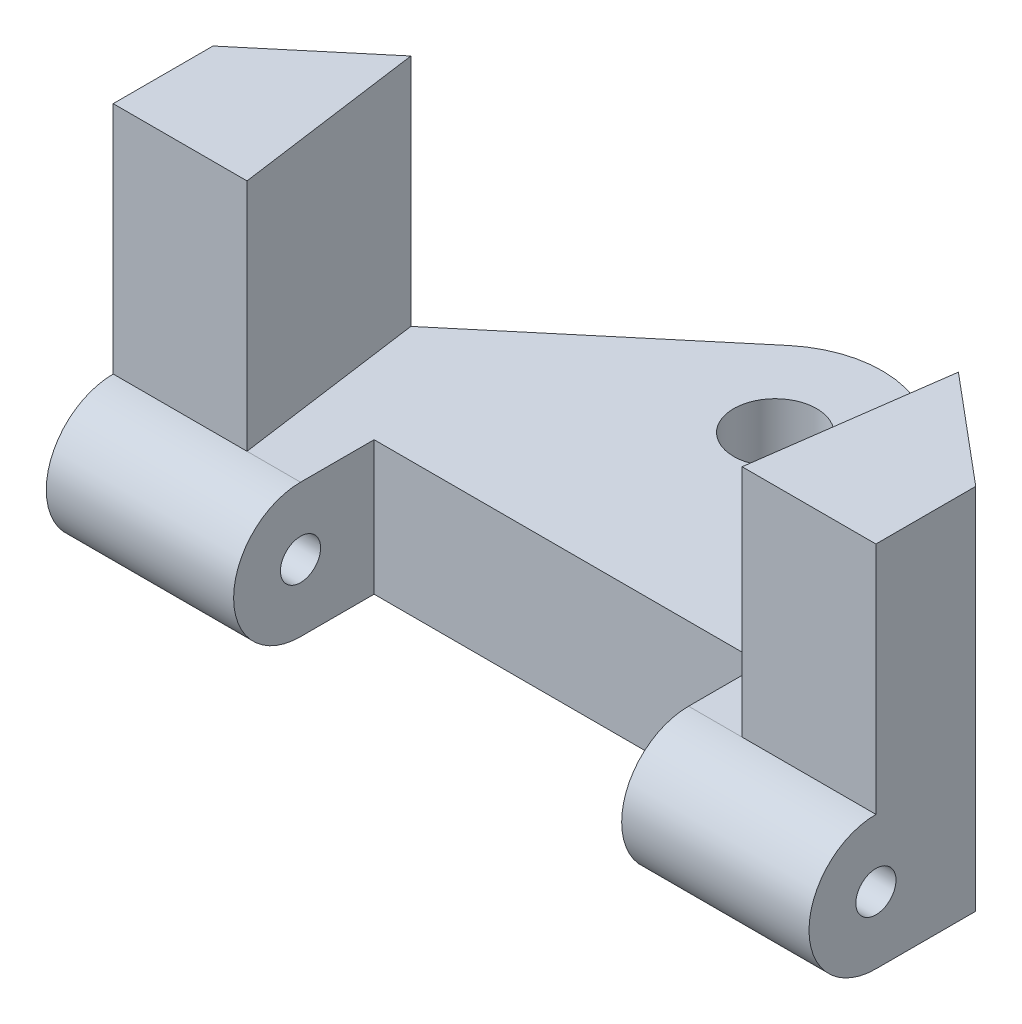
ISO-10303-21;
HEADER;
FILE_DESCRIPTION(('STEP AP214'),'2;1');
FILE_NAME('part.step','',(''),(''),'','','');
FILE_SCHEMA(('AUTOMOTIVE_DESIGN { 1 0 10303 214 1 1 1 1 }'));
ENDSEC;
DATA;
#1=APPLICATION_CONTEXT('core data for automotive mechanical design processes');
#2=APPLICATION_PROTOCOL_DEFINITION('international standard','automotive_design',2000,#1);
#3=PRODUCT_CONTEXT('',#1,'mechanical');
#4=PRODUCT('Part','Part','',(#3));
#5=PRODUCT_RELATED_PRODUCT_CATEGORY('part','',(#4));
#6=PRODUCT_DEFINITION_FORMATION('','',#4);
#7=PRODUCT_DEFINITION_CONTEXT('part definition',#1,'design');
#8=PRODUCT_DEFINITION('design','',#6,#7);
#9=PRODUCT_DEFINITION_SHAPE('','',#8);
#10=(LENGTH_UNIT() NAMED_UNIT(*) SI_UNIT(.MILLI.,.METRE.));
#11=(NAMED_UNIT(*) PLANE_ANGLE_UNIT() SI_UNIT($,.RADIAN.));
#12=(NAMED_UNIT(*) SI_UNIT($,.STERADIAN.) SOLID_ANGLE_UNIT());
#13=UNCERTAINTY_MEASURE_WITH_UNIT(LENGTH_MEASURE(1.E-05),#10,'distance_accuracy_value','');
#14=(GEOMETRIC_REPRESENTATION_CONTEXT(3) GLOBAL_UNCERTAINTY_ASSIGNED_CONTEXT((#13)) GLOBAL_UNIT_ASSIGNED_CONTEXT((#10,
#11,#12)) REPRESENTATION_CONTEXT('',''));
#15=CARTESIAN_POINT('',(0.,0.,0.));
#16=DIRECTION('',(0.,0.,1.));
#17=DIRECTION('',(1.,0.,0.));
#18=AXIS2_PLACEMENT_3D('',#15,#16,#17);
#19=CARTESIAN_POINT('',(0.,-11.9595744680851,0.));
#20=DIRECTION('',(0.,-1.,0.));
#21=DIRECTION('',(0.,0.,-1.));
#22=AXIS2_PLACEMENT_3D('',#19,#20,#21);
#23=PLANE('',#22);
#24=DIRECTION('',(-0.13663739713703,0.,0.990621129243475));
#25=VECTOR('',#24,1.);
#26=CARTESIAN_POINT('',(22.1540517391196,-11.9595744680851,3.05573127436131));
#27=LINE('',#26,#25);
#28=CARTESIAN_POINT('',(22.5349844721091,-11.9595744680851,0.293968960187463));
#29=VERTEX_POINT('',#28);
#30=CARTESIAN_POINT('',(20.5755319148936,-11.9595744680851,14.5));
#31=VERTEX_POINT('',#30);
#32=EDGE_CURVE('E313',#29,#31,#27,.T.);
#33=ORIENTED_EDGE('',*,*,#32,.T.);
#34=DIRECTION('',(-1.,0.,0.));
#35=VECTOR('',#34,1.);
#36=CARTESIAN_POINT('',(30.5755319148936,-11.9595744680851,14.5));
#37=LINE('',#36,#35);
#38=CARTESIAN_POINT('',(30.5755319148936,-11.9595744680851,14.5));
#39=VERTEX_POINT('',#38);
#40=EDGE_CURVE('E46',#39,#31,#37,.T.);
#41=ORIENTED_EDGE('',*,*,#40,.F.);
#42=DIRECTION('',(0.,0.,1.));
#43=VECTOR('',#42,1.);
#44=CARTESIAN_POINT('',(30.5755319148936,-11.9595744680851,0.));
#45=LINE('',#44,#43);
#46=CARTESIAN_POINT('',(30.5755319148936,-11.9595744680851,7.04078935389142));
#47=VERTEX_POINT('',#46);
#48=EDGE_CURVE('E115',#47,#39,#45,.T.);
#49=ORIENTED_EDGE('',*,*,#48,.F.);
#50=DIRECTION('',(0.766044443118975,0.,0.642787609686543));
#51=VECTOR('',#50,1.);
#52=CARTESIAN_POINT('',(9.16616128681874,-11.9595744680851,-10.9238056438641));
#53=LINE('',#52,#51);
#54=EDGE_CURVE('E234',#29,#47,#53,.T.);
#55=ORIENTED_EDGE('',*,*,#54,.F.);
#56=EDGE_LOOP('',(#33,#41,#49,#55));
#57=FACE_BOUND('',#56,.T.);
#58=ADVANCED_FACE('F37',(#57),#23,.F.);
#59=CARTESIAN_POINT('',(9.16616128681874,-39.4595744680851,-10.9238056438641));
#60=DIRECTION('',(-0.642787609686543,0.,0.766044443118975));
#61=DIRECTION('',(0.766044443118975,0.,0.642787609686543));
#62=AXIS2_PLACEMENT_3D('',#59,#60,#61);
#63=PLANE('',#62);
#64=DIRECTION('',(0.,1.,0.));
#65=VECTOR('',#64,1.);
#66=CARTESIAN_POINT('',(22.5349844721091,-44.0913704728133,0.293968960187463));
#67=LINE('',#66,#65);
#68=CARTESIAN_POINT('',(22.5349844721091,-29.4595744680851,0.293968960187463));
#69=VERTEX_POINT('',#68);
#70=EDGE_CURVE('E310',#69,#29,#67,.T.);
#71=ORIENTED_EDGE('',*,*,#70,.T.);
#72=ORIENTED_EDGE('',*,*,#54,.T.);
#73=DIRECTION('',(0.,1.,0.));
#74=VECTOR('',#73,1.);
#75=CARTESIAN_POINT('',(30.5755319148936,-39.4595744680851,7.04078935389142));
#76=LINE('',#75,#74);
#77=CARTESIAN_POINT('',(30.5755319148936,-39.4595744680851,7.04078935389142));
#78=VERTEX_POINT('',#77);
#79=EDGE_CURVE('E264',#78,#47,#76,.T.);
#80=ORIENTED_EDGE('',*,*,#79,.F.);
#81=DIRECTION('',(0.766044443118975,0.,0.642787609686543));
#82=VECTOR('',#81,1.);
#83=CARTESIAN_POINT('',(9.16616128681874,-39.4595744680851,-10.9238056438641));
#84=LINE('',#83,#82);
#85=CARTESIAN_POINT('',(6.68996351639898,-39.4595744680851,-13.0015822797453));
#86=VERTEX_POINT('',#85);
#87=EDGE_CURVE('E261',#86,#78,#84,.T.);
#88=ORIENTED_EDGE('',*,*,#87,.F.);
#89=DIRECTION('',(0.,1.,0.));
#90=VECTOR('',#89,1.);
#91=CARTESIAN_POINT('',(6.68996351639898,-39.4595744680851,-13.0015822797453));
#92=LINE('',#91,#90);
#93=CARTESIAN_POINT('',(6.68996351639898,-29.4595744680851,-13.0015822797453));
#94=VERTEX_POINT('',#93);
#95=EDGE_CURVE('E160',#86,#94,#92,.T.);
#96=ORIENTED_EDGE('',*,*,#95,.T.);
#97=DIRECTION('',(0.766044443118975,0.,0.642787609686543));
#98=VECTOR('',#97,1.);
#99=CARTESIAN_POINT('',(9.16616128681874,-29.4595744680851,-10.9238056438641));
#100=LINE('',#99,#98);
#101=EDGE_CURVE('E54',#94,#69,#100,.T.);
#102=ORIENTED_EDGE('',*,*,#101,.T.);
#103=EDGE_LOOP('',(#71,#72,#80,#88,#96,#102));
#104=FACE_BOUND('',#103,.T.);
#105=ADVANCED_FACE('F342',(#104),#63,.F.);
#106=CARTESIAN_POINT('',(-16.4244680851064,-29.4595744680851,9.));
#107=DIRECTION('',(0.,1.,0.));
#108=DIRECTION('',(0.,0.,1.));
#109=AXIS2_PLACEMENT_3D('',#106,#107,#108);
#110=PLANE('',#109);
#111=DIRECTION('',(-0.766044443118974,0.,0.642787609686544));
#112=VECTOR('',#111,1.);
#113=CARTESIAN_POINT('',(-7.45104170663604,-29.4595744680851,-8.87980572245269));
#114=LINE('',#113,#112);
#115=CARTESIAN_POINT('',(-3.04328166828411,-29.4595744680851,-12.5783555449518));
#116=VERTEX_POINT('',#115);
#117=CARTESIAN_POINT('',(-18.3839206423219,-29.4595744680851,0.29396896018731));
#118=VERTEX_POINT('',#117);
#119=EDGE_CURVE('E233',#116,#118,#114,.T.);
#120=ORIENTED_EDGE('',*,*,#119,.T.);
#121=DIRECTION('',(-0.136637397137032,0.,-0.990621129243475));
#122=VECTOR('',#121,1.);
#123=CARTESIAN_POINT('',(-18.0804873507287,-29.4595744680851,2.49386032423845));
#124=LINE('',#123,#122);
#125=CARTESIAN_POINT('',(-16.4244680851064,-29.4595744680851,14.5));
#126=VERTEX_POINT('',#125);
#127=EDGE_CURVE('E217',#126,#118,#124,.T.);
#128=ORIENTED_EDGE('',*,*,#127,.F.);
#129=DIRECTION('',(-1.,0.,0.));
#130=VECTOR('',#129,1.);
#131=CARTESIAN_POINT('',(-12.4244680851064,-29.4595744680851,14.5));
#132=LINE('',#131,#130);
#133=CARTESIAN_POINT('',(-12.4244680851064,-29.4595744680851,14.5));
#134=VERTEX_POINT('',#133);
#135=EDGE_CURVE('E173',#134,#126,#132,.T.);
#136=ORIENTED_EDGE('',*,*,#135,.F.);
#137=DIRECTION('',(0.,0.,1.));
#138=VECTOR('',#137,1.);
#139=CARTESIAN_POINT('',(-12.4244680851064,-29.4595744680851,0.));
#140=LINE('',#139,#138);
#141=CARTESIAN_POINT('',(-12.4244680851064,-29.4595744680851,9.));
#142=VERTEX_POINT('',#141);
#143=EDGE_CURVE('E133',#142,#134,#140,.T.);
#144=ORIENTED_EDGE('',*,*,#143,.F.);
#145=DIRECTION('',(1.,0.,0.));
#146=VECTOR('',#145,1.);
#147=CARTESIAN_POINT('',(-16.4244680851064,-29.4595744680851,9.));
#148=LINE('',#147,#146);
#149=CARTESIAN_POINT('',(16.5755319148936,-29.4595744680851,9.));
#150=VERTEX_POINT('',#149);
#151=EDGE_CURVE('E169',#142,#150,#148,.T.);
#152=ORIENTED_EDGE('',*,*,#151,.T.);
#153=DIRECTION('',(0.,0.,1.));
#154=VECTOR('',#153,1.);
#155=CARTESIAN_POINT('',(16.5755319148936,-29.4595744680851,0.));
#156=LINE('',#155,#154);
#157=CARTESIAN_POINT('',(16.5755319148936,-29.4595744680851,14.5));
#158=VERTEX_POINT('',#157);
#159=EDGE_CURVE('E168',#150,#158,#156,.T.);
#160=ORIENTED_EDGE('',*,*,#159,.T.);
#161=DIRECTION('',(1.,0.,0.));
#162=VECTOR('',#161,1.);
#163=CARTESIAN_POINT('',(16.5755319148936,-29.4595744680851,14.5));
#164=LINE('',#163,#162);
#165=CARTESIAN_POINT('',(20.5755319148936,-29.4595744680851,14.5));
#166=VERTEX_POINT('',#165);
#167=EDGE_CURVE('E172',#158,#166,#164,.T.);
#168=ORIENTED_EDGE('',*,*,#167,.T.);
#169=DIRECTION('',(0.13663739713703,0.,-0.990621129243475));
#170=VECTOR('',#169,1.);
#171=CARTESIAN_POINT('',(22.1540517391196,-29.4595744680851,3.05573127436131));
#172=LINE('',#171,#170);
#173=EDGE_CURVE('E312',#166,#69,#172,.T.);
#174=ORIENTED_EDGE('',*,*,#173,.T.);
#175=ORIENTED_EDGE('',*,*,#101,.F.);
#176=CARTESIAN_POINT('',(2.09901920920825,-29.4595744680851,-6.45));
#177=DIRECTION('',(0.,1.,0.));
#178=DIRECTION('',(0.,0.,1.));
#179=AXIS2_PLACEMENT_3D('',#176,#177,#178);
#180=CIRCLE('',#179,8.);
#181=EDGE_CURVE('E284',#94,#116,#180,.T.);
#182=ORIENTED_EDGE('',*,*,#181,.T.);
#183=EDGE_LOOP('',(#120,#128,#136,#144,#152,#160,#168,#174,#175,#182));
#184=FACE_BOUND('',#183,.T.);
#185=CARTESIAN_POINT('',(2.09901920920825,-29.4595744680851,-6.45));
#186=DIRECTION('',(0.,1.,0.));
#187=DIRECTION('',(0.,0.,1.));
#188=AXIS2_PLACEMENT_3D('',#185,#186,#187);
#189=CIRCLE('',#188,3.1);
#190=CARTESIAN_POINT('',(2.09901920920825,-29.4595744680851,-3.35));
#191=VERTEX_POINT('',#190);
#192=EDGE_CURVE('E290',#191,#191,#189,.T.);
#193=ORIENTED_EDGE('',*,*,#192,.F.);
#194=EDGE_LOOP('',(#193));
#195=FACE_BOUND('',#194,.T.);
#196=ADVANCED_FACE('F228',(#184,#195),#110,.T.);
#197=CARTESIAN_POINT('',(0.,0.,9.));
#198=DIRECTION('',(0.,0.,1.));
#199=DIRECTION('',(1.,0.,0.));
#200=AXIS2_PLACEMENT_3D('',#197,#198,#199);
#201=PLANE('',#200);
#202=DIRECTION('',(1.,0.,0.));
#203=VECTOR('',#202,1.);
#204=CARTESIAN_POINT('',(-26.4244680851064,-39.4595744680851,9.));
#205=LINE('',#204,#203);
#206=CARTESIAN_POINT('',(-12.4244680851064,-39.4595744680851,9.));
#207=VERTEX_POINT('',#206);
#208=CARTESIAN_POINT('',(16.5755319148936,-39.4595744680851,9.));
#209=VERTEX_POINT('',#208);
#210=EDGE_CURVE('E164',#207,#209,#205,.T.);
#211=ORIENTED_EDGE('',*,*,#210,.T.);
#212=DIRECTION('',(0.,1.,0.));
#213=VECTOR('',#212,1.);
#214=CARTESIAN_POINT('',(16.5755319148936,0.,9.));
#215=LINE('',#214,#213);
#216=EDGE_CURVE('E167',#209,#150,#215,.T.);
#217=ORIENTED_EDGE('',*,*,#216,.T.);
#218=ORIENTED_EDGE('',*,*,#151,.F.);
#219=DIRECTION('',(0.,1.,0.));
#220=VECTOR('',#219,1.);
#221=CARTESIAN_POINT('',(-12.4244680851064,0.,9.));
#222=LINE('',#221,#220);
#223=EDGE_CURVE('E186',#207,#142,#222,.T.);
#224=ORIENTED_EDGE('',*,*,#223,.F.);
#225=EDGE_LOOP('',(#211,#217,#218,#224));
#226=FACE_BOUND('',#225,.T.);
#227=ADVANCED_FACE('F253',(#226),#201,.T.);
#228=CARTESIAN_POINT('',(-26.4244680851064,15.5404255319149,9.));
#229=DIRECTION('',(1.,0.,0.));
#230=DIRECTION('',(0.,1.,0.));
#231=AXIS2_PLACEMENT_3D('',#228,#229,#230);
#232=PLANE('',#231);
#233=DIRECTION('',(0.,0.,-1.));
#234=VECTOR('',#233,1.);
#235=CARTESIAN_POINT('',(-26.4244680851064,-11.9595744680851,14.5));
#236=LINE('',#235,#234);
#237=CARTESIAN_POINT('',(-26.4244680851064,-11.9595744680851,14.5));
#238=VERTEX_POINT('',#237);
#239=CARTESIAN_POINT('',(-26.4244680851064,-11.9595744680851,7.04078935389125));
#240=VERTEX_POINT('',#239);
#241=EDGE_CURVE('E41',#238,#240,#236,.T.);
#242=ORIENTED_EDGE('',*,*,#241,.T.);
#243=DIRECTION('',(0.,-1.,0.));
#244=VECTOR('',#243,1.);
#245=CARTESIAN_POINT('',(-26.4244680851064,-11.9595744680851,7.04078935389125));
#246=LINE('',#245,#244);
#247=CARTESIAN_POINT('',(-26.4244680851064,-39.4595744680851,7.04078935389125));
#248=VERTEX_POINT('',#247);
#249=EDGE_CURVE('E296',#240,#248,#246,.T.);
#250=ORIENTED_EDGE('',*,*,#249,.T.);
#251=DIRECTION('',(0.,0.,-1.));
#252=VECTOR('',#251,1.);
#253=CARTESIAN_POINT('',(-26.4244680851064,-39.4595744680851,9.));
#254=LINE('',#253,#252);
#255=CARTESIAN_POINT('',(-26.4244680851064,-39.4595744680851,14.5));
#256=VERTEX_POINT('',#255);
#257=EDGE_CURVE('E148',#256,#248,#254,.T.);
#258=ORIENTED_EDGE('',*,*,#257,.F.);
#259=CARTESIAN_POINT('',(-26.4244680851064,-34.4595744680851,14.5));
#260=DIRECTION('',(-1.,0.,0.));
#261=DIRECTION('',(0.,-1.,0.));
#262=AXIS2_PLACEMENT_3D('',#259,#260,#261);
#263=CIRCLE('',#262,5.00000000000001);
#264=CARTESIAN_POINT('',(-26.4244680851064,-29.4595744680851,14.5));
#265=VERTEX_POINT('',#264);
#266=EDGE_CURVE('E177',#256,#265,#263,.T.);
#267=ORIENTED_EDGE('',*,*,#266,.T.);
#268=DIRECTION('',(0.,-1.,0.));
#269=VECTOR('',#268,1.);
#270=CARTESIAN_POINT('',(-26.4244680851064,16.9531377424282,14.5));
#271=LINE('',#270,#269);
#272=EDGE_CURVE('E146',#238,#265,#271,.T.);
#273=ORIENTED_EDGE('',*,*,#272,.F.);
#274=EDGE_LOOP('',(#242,#250,#258,#267,#273));
#275=FACE_BOUND('',#274,.T.);
#276=CARTESIAN_POINT('',(-26.4244680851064,-34.4595744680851,14.5));
#277=DIRECTION('',(-1.,0.,0.));
#278=DIRECTION('',(0.,-1.,0.));
#279=AXIS2_PLACEMENT_3D('',#276,#277,#278);
#280=CIRCLE('',#279,1.5);
#281=CARTESIAN_POINT('',(-26.4244680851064,-35.9595744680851,14.5));
#282=VERTEX_POINT('',#281);
#283=EDGE_CURVE('E180',#282,#282,#280,.T.);
#284=ORIENTED_EDGE('',*,*,#283,.F.);
#285=EDGE_LOOP('',(#284));
#286=FACE_BOUND('',#285,.T.);
#287=ADVANCED_FACE('F323',(#275,#286),#232,.F.);
#288=CARTESIAN_POINT('',(-26.4244680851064,-39.4595744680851,9.));
#289=DIRECTION('',(0.,1.,0.));
#290=DIRECTION('',(0.,0.,1.));
#291=AXIS2_PLACEMENT_3D('',#288,#289,#290);
#292=PLANE('',#291);
#293=ORIENTED_EDGE('',*,*,#87,.T.);
#294=DIRECTION('',(0.,0.,-1.));
#295=VECTOR('',#294,1.);
#296=CARTESIAN_POINT('',(30.5755319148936,-39.4595744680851,9.));
#297=LINE('',#296,#295);
#298=CARTESIAN_POINT('',(30.5755319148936,-39.4595744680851,14.5));
#299=VERTEX_POINT('',#298);
#300=EDGE_CURVE('E120',#299,#78,#297,.T.);
#301=ORIENTED_EDGE('',*,*,#300,.F.);
#302=DIRECTION('',(1.,0.,0.));
#303=VECTOR('',#302,1.);
#304=CARTESIAN_POINT('',(16.5755319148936,-39.4595744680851,14.5));
#305=LINE('',#304,#303);
#306=CARTESIAN_POINT('',(16.5755319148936,-39.4595744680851,14.5));
#307=VERTEX_POINT('',#306);
#308=EDGE_CURVE('E132',#307,#299,#305,.T.);
#309=ORIENTED_EDGE('',*,*,#308,.F.);
#310=DIRECTION('',(0.,0.,1.));
#311=VECTOR('',#310,1.);
#312=CARTESIAN_POINT('',(16.5755319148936,-39.4595744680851,0.));
#313=LINE('',#312,#311);
#314=EDGE_CURVE('E147',#209,#307,#313,.T.);
#315=ORIENTED_EDGE('',*,*,#314,.F.);
#316=ORIENTED_EDGE('',*,*,#210,.F.);
#317=DIRECTION('',(0.,0.,1.));
#318=VECTOR('',#317,1.);
#319=CARTESIAN_POINT('',(-12.4244680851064,-39.4595744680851,0.));
#320=LINE('',#319,#318);
#321=CARTESIAN_POINT('',(-12.4244680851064,-39.4595744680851,14.5));
#322=VERTEX_POINT('',#321);
#323=EDGE_CURVE('E156',#207,#322,#320,.T.);
#324=ORIENTED_EDGE('',*,*,#323,.T.);
#325=DIRECTION('',(-1.,0.,0.));
#326=VECTOR('',#325,1.);
#327=CARTESIAN_POINT('',(-12.4244680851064,-39.4595744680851,14.5));
#328=LINE('',#327,#326);
#329=EDGE_CURVE('E150',#322,#256,#328,.T.);
#330=ORIENTED_EDGE('',*,*,#329,.T.);
#331=ORIENTED_EDGE('',*,*,#257,.T.);
#332=DIRECTION('',(-0.766044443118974,0.,0.642787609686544));
#333=VECTOR('',#332,1.);
#334=CARTESIAN_POINT('',(-7.45104170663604,-39.4595744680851,-8.87980572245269));
#335=LINE('',#334,#333);
#336=CARTESIAN_POINT('',(-3.04328166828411,-39.4595744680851,-12.5783555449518));
#337=VERTEX_POINT('',#336);
#338=EDGE_CURVE('E300',#337,#248,#335,.T.);
#339=ORIENTED_EDGE('',*,*,#338,.F.);
#340=CARTESIAN_POINT('',(2.09901920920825,-39.4595744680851,-6.45));
#341=DIRECTION('',(0.,1.,0.));
#342=DIRECTION('',(0.,0.,1.));
#343=AXIS2_PLACEMENT_3D('',#340,#341,#342);
#344=CIRCLE('',#343,8.);
#345=EDGE_CURVE('E285',#86,#337,#344,.T.);
#346=ORIENTED_EDGE('',*,*,#345,.F.);
#347=EDGE_LOOP('',(#293,#301,#309,#315,#316,#324,#330,#331,#339,#346));
#348=FACE_BOUND('',#347,.T.);
#349=CARTESIAN_POINT('',(2.09901920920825,-39.4595744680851,-6.45));
#350=DIRECTION('',(0.,1.,0.));
#351=DIRECTION('',(0.,0.,1.));
#352=AXIS2_PLACEMENT_3D('',#349,#350,#351);
#353=CIRCLE('',#352,3.1);
#354=CARTESIAN_POINT('',(2.09901920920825,-39.4595744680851,-3.35));
#355=VERTEX_POINT('',#354);
#356=EDGE_CURVE('E297',#355,#355,#353,.T.);
#357=ORIENTED_EDGE('',*,*,#356,.T.);
#358=EDGE_LOOP('',(#357));
#359=FACE_BOUND('',#358,.T.);
#360=ADVANCED_FACE('F249',(#348,#359),#292,.F.);
#361=CARTESIAN_POINT('',(30.5755319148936,15.5404255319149,9.));
#362=DIRECTION('',(-1.,0.,0.));
#363=DIRECTION('',(0.,-1.,0.));
#364=AXIS2_PLACEMENT_3D('',#361,#362,#363);
#365=PLANE('',#364);
#366=ORIENTED_EDGE('',*,*,#300,.T.);
#367=ORIENTED_EDGE('',*,*,#79,.T.);
#368=ORIENTED_EDGE('',*,*,#48,.T.);
#369=DIRECTION('',(0.,-1.,0.));
#370=VECTOR('',#369,1.);
#371=CARTESIAN_POINT('',(30.5755319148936,16.9531377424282,14.5));
#372=LINE('',#371,#370);
#373=CARTESIAN_POINT('',(30.5755319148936,-29.4595744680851,14.5));
#374=VERTEX_POINT('',#373);
#375=EDGE_CURVE('E108',#39,#374,#372,.T.);
#376=ORIENTED_EDGE('',*,*,#375,.T.);
#377=CARTESIAN_POINT('',(30.5755319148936,-34.4595744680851,14.5));
#378=DIRECTION('',(-1.,0.,0.));
#379=DIRECTION('',(0.,-1.,0.));
#380=AXIS2_PLACEMENT_3D('',#377,#378,#379);
#381=CIRCLE('',#380,5.00000000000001);
#382=EDGE_CURVE('E112',#299,#374,#381,.T.);
#383=ORIENTED_EDGE('',*,*,#382,.F.);
#384=EDGE_LOOP('',(#366,#367,#368,#376,#383));
#385=FACE_BOUND('',#384,.T.);
#386=CARTESIAN_POINT('',(30.5755319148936,-34.4595744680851,14.5));
#387=DIRECTION('',(-1.,0.,0.));
#388=DIRECTION('',(0.,-1.,0.));
#389=AXIS2_PLACEMENT_3D('',#386,#387,#388);
#390=CIRCLE('',#389,1.5);
#391=CARTESIAN_POINT('',(30.5755319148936,-35.9595744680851,14.5));
#392=VERTEX_POINT('',#391);
#393=EDGE_CURVE('E163',#392,#392,#390,.T.);
#394=ORIENTED_EDGE('',*,*,#393,.T.);
#395=EDGE_LOOP('',(#394));
#396=FACE_BOUND('',#395,.T.);
#397=ADVANCED_FACE('F39',(#385,#396),#365,.F.);
#398=CARTESIAN_POINT('',(-12.4244680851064,-34.4595744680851,14.5));
#399=DIRECTION('',(-1.,0.,0.));
#400=DIRECTION('',(0.,-1.,0.));
#401=AXIS2_PLACEMENT_3D('',#398,#399,#400);
#402=CYLINDRICAL_SURFACE('',#401,5.00000000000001);
#403=ORIENTED_EDGE('',*,*,#266,.F.);
#404=ORIENTED_EDGE('',*,*,#329,.F.);
#405=CARTESIAN_POINT('',(-12.4244680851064,-34.4595744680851,14.5));
#406=DIRECTION('',(-1.,0.,0.));
#407=DIRECTION('',(0.,-1.,0.));
#408=AXIS2_PLACEMENT_3D('',#405,#406,#407);
#409=CIRCLE('',#408,5.00000000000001);
#410=EDGE_CURVE('E175',#322,#134,#409,.T.);
#411=ORIENTED_EDGE('',*,*,#410,.T.);
#412=ORIENTED_EDGE('',*,*,#135,.T.);
#413=DIRECTION('',(-1.,0.,0.));
#414=VECTOR('',#413,1.);
#415=CARTESIAN_POINT('',(0.,-29.4595744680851,14.5));
#416=LINE('',#415,#414);
#417=EDGE_CURVE('E141',#126,#265,#416,.T.);
#418=ORIENTED_EDGE('',*,*,#417,.T.);
#419=EDGE_LOOP('',(#403,#404,#411,#412,#418));
#420=FACE_BOUND('',#419,.T.);
#421=ADVANCED_FACE('F242',(#420),#402,.T.);
#422=CARTESIAN_POINT('',(-12.4244680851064,-34.4595744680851,14.5));
#423=DIRECTION('',(-1.,0.,0.));
#424=DIRECTION('',(0.,-1.,0.));
#425=AXIS2_PLACEMENT_3D('',#422,#423,#424);
#426=CYLINDRICAL_SURFACE('',#425,1.5);
#427=CARTESIAN_POINT('',(-12.4244680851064,-34.4595744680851,14.5));
#428=DIRECTION('',(-1.,0.,0.));
#429=DIRECTION('',(0.,-1.,0.));
#430=AXIS2_PLACEMENT_3D('',#427,#428,#429);
#431=CIRCLE('',#430,1.5);
#432=CARTESIAN_POINT('',(-12.4244680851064,-35.9595744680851,14.5));
#433=VERTEX_POINT('',#432);
#434=EDGE_CURVE('E183',#433,#433,#431,.T.);
#435=ORIENTED_EDGE('',*,*,#434,.F.);
#436=EDGE_LOOP('',(#435));
#437=FACE_BOUND('',#436,.T.);
#438=ORIENTED_EDGE('',*,*,#283,.T.);
#439=EDGE_LOOP('',(#438));
#440=FACE_BOUND('',#439,.T.);
#441=ADVANCED_FACE('F328',(#437,#440),#426,.F.);
#442=CARTESIAN_POINT('',(-12.4244680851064,0.,0.));
#443=DIRECTION('',(-1.,0.,0.));
#444=DIRECTION('',(0.,-1.,0.));
#445=AXIS2_PLACEMENT_3D('',#442,#443,#444);
#446=PLANE('',#445);
#447=ORIENTED_EDGE('',*,*,#434,.T.);
#448=EDGE_LOOP('',(#447));
#449=FACE_BOUND('',#448,.T.);
#450=ORIENTED_EDGE('',*,*,#410,.F.);
#451=ORIENTED_EDGE('',*,*,#323,.F.);
#452=ORIENTED_EDGE('',*,*,#223,.T.);
#453=ORIENTED_EDGE('',*,*,#143,.T.);
#454=EDGE_LOOP('',(#450,#451,#452,#453));
#455=FACE_BOUND('',#454,.T.);
#456=ADVANCED_FACE('F245',(#449,#455),#446,.F.);
#457=CARTESIAN_POINT('',(16.5755319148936,-34.4595744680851,14.5));
#458=DIRECTION('',(1.,0.,0.));
#459=DIRECTION('',(0.,1.,0.));
#460=AXIS2_PLACEMENT_3D('',#457,#458,#459);
#461=CYLINDRICAL_SURFACE('',#460,5.00000000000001);
#462=ORIENTED_EDGE('',*,*,#382,.T.);
#463=DIRECTION('',(-1.,0.,0.));
#464=VECTOR('',#463,1.);
#465=CARTESIAN_POINT('',(30.5755319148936,-29.4595744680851,14.5));
#466=LINE('',#465,#464);
#467=EDGE_CURVE('E128',#374,#166,#466,.T.);
#468=ORIENTED_EDGE('',*,*,#467,.T.);
#469=ORIENTED_EDGE('',*,*,#167,.F.);
#470=CARTESIAN_POINT('',(16.5755319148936,-34.4595744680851,14.5));
#471=DIRECTION('',(-1.,0.,0.));
#472=DIRECTION('',(0.,-1.,0.));
#473=AXIS2_PLACEMENT_3D('',#470,#471,#472);
#474=CIRCLE('',#473,5.00000000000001);
#475=EDGE_CURVE('E203',#307,#158,#474,.T.);
#476=ORIENTED_EDGE('',*,*,#475,.F.);
#477=ORIENTED_EDGE('',*,*,#308,.T.);
#478=EDGE_LOOP('',(#462,#468,#469,#476,#477));
#479=FACE_BOUND('',#478,.T.);
#480=ADVANCED_FACE('F125',(#479),#461,.T.);
#481=CARTESIAN_POINT('',(16.5755319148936,-34.4595744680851,14.5));
#482=DIRECTION('',(1.,0.,0.));
#483=DIRECTION('',(0.,1.,0.));
#484=AXIS2_PLACEMENT_3D('',#481,#482,#483);
#485=CYLINDRICAL_SURFACE('',#484,1.5);
#486=CARTESIAN_POINT('',(16.5755319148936,-34.4595744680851,14.5));
#487=DIRECTION('',(-1.,0.,0.));
#488=DIRECTION('',(0.,-1.,0.));
#489=AXIS2_PLACEMENT_3D('',#486,#487,#488);
#490=CIRCLE('',#489,1.5);
#491=CARTESIAN_POINT('',(16.5755319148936,-35.9595744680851,14.5));
#492=VERTEX_POINT('',#491);
#493=EDGE_CURVE('E138',#492,#492,#490,.T.);
#494=ORIENTED_EDGE('',*,*,#493,.T.);
#495=EDGE_LOOP('',(#494));
#496=FACE_BOUND('',#495,.T.);
#497=ORIENTED_EDGE('',*,*,#393,.F.);
#498=EDGE_LOOP('',(#497));
#499=FACE_BOUND('',#498,.T.);
#500=ADVANCED_FACE('F363',(#496,#499),#485,.F.);
#501=CARTESIAN_POINT('',(16.5755319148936,0.,0.));
#502=DIRECTION('',(1.,0.,0.));
#503=DIRECTION('',(0.,-1.,0.));
#504=AXIS2_PLACEMENT_3D('',#501,#502,#503);
#505=PLANE('',#504);
#506=ORIENTED_EDGE('',*,*,#493,.F.);
#507=EDGE_LOOP('',(#506));
#508=FACE_BOUND('',#507,.T.);
#509=ORIENTED_EDGE('',*,*,#475,.T.);
#510=ORIENTED_EDGE('',*,*,#159,.F.);
#511=ORIENTED_EDGE('',*,*,#216,.F.);
#512=ORIENTED_EDGE('',*,*,#314,.T.);
#513=EDGE_LOOP('',(#509,#510,#511,#512));
#514=FACE_BOUND('',#513,.T.);
#515=ADVANCED_FACE('F257',(#508,#514),#505,.F.);
#516=CARTESIAN_POINT('',(0.,16.9531377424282,14.5));
#517=DIRECTION('',(0.,0.,1.));
#518=DIRECTION('',(1.,0.,0.));
#519=AXIS2_PLACEMENT_3D('',#516,#517,#518);
#520=PLANE('',#519);
#521=DIRECTION('',(-1.,0.,0.));
#522=VECTOR('',#521,1.);
#523=CARTESIAN_POINT('',(-12.4244680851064,-11.9595744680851,14.5));
#524=LINE('',#523,#522);
#525=CARTESIAN_POINT('',(-16.4244680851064,-11.9595744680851,14.5));
#526=VERTEX_POINT('',#525);
#527=EDGE_CURVE('E144',#526,#238,#524,.T.);
#528=ORIENTED_EDGE('',*,*,#527,.T.);
#529=ORIENTED_EDGE('',*,*,#272,.T.);
#530=ORIENTED_EDGE('',*,*,#417,.F.);
#531=DIRECTION('',(0.,-1.,0.));
#532=VECTOR('',#531,1.);
#533=CARTESIAN_POINT('',(-16.4244680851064,16.9531377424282,14.5));
#534=LINE('',#533,#532);
#535=EDGE_CURVE('E191',#526,#126,#534,.T.);
#536=ORIENTED_EDGE('',*,*,#535,.F.);
#537=EDGE_LOOP('',(#528,#529,#530,#536));
#538=FACE_BOUND('',#537,.T.);
#539=ADVANCED_FACE('F238',(#538),#520,.T.);
#540=CARTESIAN_POINT('',(30.5755319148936,16.9531377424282,14.5));
#541=DIRECTION('',(0.,0.,1.));
#542=DIRECTION('',(1.,0.,0.));
#543=AXIS2_PLACEMENT_3D('',#540,#541,#542);
#544=PLANE('',#543);
#545=ORIENTED_EDGE('',*,*,#40,.T.);
#546=DIRECTION('',(0.,-1.,0.));
#547=VECTOR('',#546,1.);
#548=CARTESIAN_POINT('',(20.5755319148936,16.9531377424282,14.5));
#549=LINE('',#548,#547);
#550=EDGE_CURVE('E11',#31,#166,#549,.T.);
#551=ORIENTED_EDGE('',*,*,#550,.T.);
#552=ORIENTED_EDGE('',*,*,#467,.F.);
#553=ORIENTED_EDGE('',*,*,#375,.F.);
#554=EDGE_LOOP('',(#545,#551,#552,#553));
#555=FACE_BOUND('',#554,.T.);
#556=ADVANCED_FACE('F135',(#555),#544,.T.);
#557=ORIENTED_EDGE('',*,*,#527,.F.);
#558=DIRECTION('',(0.136637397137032,0.,0.990621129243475));
#559=VECTOR('',#558,1.);
#560=CARTESIAN_POINT('',(-18.0804873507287,-11.9595744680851,2.49386032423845));
#561=LINE('',#560,#559);
#562=CARTESIAN_POINT('',(-18.3839206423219,-11.9595744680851,0.29396896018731));
#563=VERTEX_POINT('',#562);
#564=EDGE_CURVE('E221',#563,#526,#561,.T.);
#565=ORIENTED_EDGE('',*,*,#564,.F.);
#566=DIRECTION('',(-0.766044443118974,0.,0.642787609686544));
#567=VECTOR('',#566,1.);
#568=CARTESIAN_POINT('',(-7.45104170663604,-11.9595744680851,-8.87980572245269));
#569=LINE('',#568,#567);
#570=EDGE_CURVE('E306',#563,#240,#569,.T.);
#571=ORIENTED_EDGE('',*,*,#570,.T.);
#572=ORIENTED_EDGE('',*,*,#241,.F.);
#573=EDGE_LOOP('',(#557,#565,#571,#572));
#574=FACE_BOUND('',#573,.T.);
#575=ADVANCED_FACE('F320',(#574),#23,.F.);
#576=CARTESIAN_POINT('',(-7.45104170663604,-39.4595744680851,-8.87980572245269));
#577=DIRECTION('',(-0.642787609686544,0.,-0.766044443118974));
#578=DIRECTION('',(-0.766044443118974,0.,0.642787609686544));
#579=AXIS2_PLACEMENT_3D('',#576,#577,#578);
#580=PLANE('',#579);
#581=DIRECTION('',(0.,1.,0.));
#582=VECTOR('',#581,1.);
#583=CARTESIAN_POINT('',(-18.3839206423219,-44.0913704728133,0.29396896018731));
#584=LINE('',#583,#582);
#585=EDGE_CURVE('E235',#118,#563,#584,.T.);
#586=ORIENTED_EDGE('',*,*,#585,.F.);
#587=ORIENTED_EDGE('',*,*,#119,.F.);
#588=DIRECTION('',(0.,1.,0.));
#589=VECTOR('',#588,1.);
#590=CARTESIAN_POINT('',(-3.04328166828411,-39.4595744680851,-12.5783555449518));
#591=LINE('',#590,#589);
#592=EDGE_CURVE('E194',#337,#116,#591,.T.);
#593=ORIENTED_EDGE('',*,*,#592,.F.);
#594=ORIENTED_EDGE('',*,*,#338,.T.);
#595=ORIENTED_EDGE('',*,*,#249,.F.);
#596=ORIENTED_EDGE('',*,*,#570,.F.);
#597=EDGE_LOOP('',(#586,#587,#593,#594,#595,#596));
#598=FACE_BOUND('',#597,.T.);
#599=ADVANCED_FACE('F288',(#598),#580,.T.);
#600=CARTESIAN_POINT('',(2.09901920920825,-39.4595744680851,-6.45));
#601=DIRECTION('',(0.,1.,0.));
#602=DIRECTION('',(0.,0.,1.));
#603=AXIS2_PLACEMENT_3D('',#600,#601,#602);
#604=CYLINDRICAL_SURFACE('',#603,8.);
#605=ORIENTED_EDGE('',*,*,#181,.F.);
#606=ORIENTED_EDGE('',*,*,#95,.F.);
#607=ORIENTED_EDGE('',*,*,#345,.T.);
#608=ORIENTED_EDGE('',*,*,#592,.T.);
#609=EDGE_LOOP('',(#605,#606,#607,#608));
#610=FACE_BOUND('',#609,.T.);
#611=ADVANCED_FACE('F283',(#610),#604,.T.);
#612=CARTESIAN_POINT('',(2.09901920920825,-39.4595744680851,-6.45));
#613=DIRECTION('',(0.,1.,0.));
#614=DIRECTION('',(0.,0.,1.));
#615=AXIS2_PLACEMENT_3D('',#612,#613,#614);
#616=CYLINDRICAL_SURFACE('',#615,3.1);
#617=ORIENTED_EDGE('',*,*,#356,.F.);
#618=EDGE_LOOP('',(#617));
#619=FACE_BOUND('',#618,.T.);
#620=ORIENTED_EDGE('',*,*,#192,.T.);
#621=EDGE_LOOP('',(#620));
#622=FACE_BOUND('',#621,.T.);
#623=ADVANCED_FACE('F404',(#619,#622),#616,.F.);
#624=CARTESIAN_POINT('',(22.1540517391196,-44.0913704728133,3.05573127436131));
#625=DIRECTION('',(-0.990621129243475,0.,-0.13663739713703));
#626=DIRECTION('',(-0.13663739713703,0.,0.990621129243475));
#627=AXIS2_PLACEMENT_3D('',#624,#625,#626);
#628=PLANE('',#627);
#629=ORIENTED_EDGE('',*,*,#550,.F.);
#630=ORIENTED_EDGE('',*,*,#32,.F.);
#631=ORIENTED_EDGE('',*,*,#70,.F.);
#632=ORIENTED_EDGE('',*,*,#173,.F.);
#633=EDGE_LOOP('',(#629,#630,#631,#632));
#634=FACE_BOUND('',#633,.T.);
#635=ADVANCED_FACE('F446',(#634),#628,.T.);
#636=CARTESIAN_POINT('',(-18.0804873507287,-44.0913704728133,2.49386032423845));
#637=DIRECTION('',(-0.990621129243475,0.,0.136637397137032));
#638=DIRECTION('',(0.136637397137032,0.,0.990621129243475));
#639=AXIS2_PLACEMENT_3D('',#636,#637,#638);
#640=PLANE('',#639);
#641=ORIENTED_EDGE('',*,*,#127,.T.);
#642=ORIENTED_EDGE('',*,*,#585,.T.);
#643=ORIENTED_EDGE('',*,*,#564,.T.);
#644=ORIENTED_EDGE('',*,*,#535,.T.);
#645=EDGE_LOOP('',(#641,#642,#643,#644));
#646=FACE_BOUND('',#645,.T.);
#647=ADVANCED_FACE('F214',(#646),#640,.F.);
#648=CLOSED_SHELL('',(#58,#105,#196,#227,#287,#360,#397,#421,#441,#456,#480,#500,#515,#539,#556,
#575,#599,#611,#623,#635,#647));
#649=MANIFOLD_SOLID_BREP('B2',#648);
#650=ADVANCED_BREP_SHAPE_REPRESENTATION('',(#18,#649),#14);
#651=SHAPE_DEFINITION_REPRESENTATION(#9,#650);
ENDSEC;
END-ISO-10303-21;
